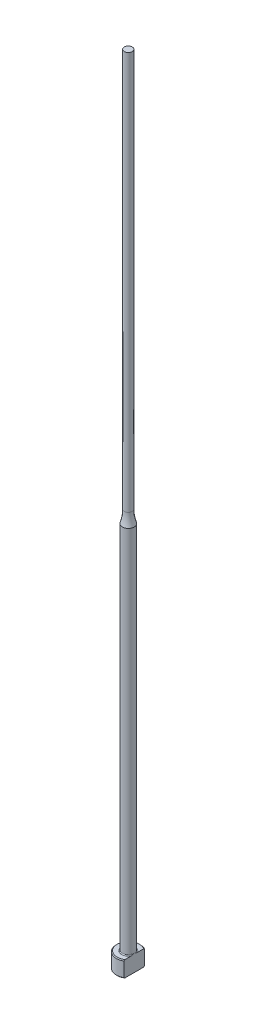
ISO-10303-21;
HEADER;
FILE_DESCRIPTION(('STEP AP214'),'2;1');
FILE_NAME('part.step','',(''),(''),'','','');
FILE_SCHEMA(('AUTOMOTIVE_DESIGN { 1 0 10303 214 1 1 1 1 }'));
ENDSEC;
DATA;
#1=APPLICATION_CONTEXT('core data for automotive mechanical design processes');
#2=APPLICATION_PROTOCOL_DEFINITION('international standard','automotive_design',2000,#1);
#3=PRODUCT_CONTEXT('',#1,'mechanical');
#4=PRODUCT('Part','Part','',(#3));
#5=PRODUCT_RELATED_PRODUCT_CATEGORY('part','',(#4));
#6=PRODUCT_DEFINITION_FORMATION('','',#4);
#7=PRODUCT_DEFINITION_CONTEXT('part definition',#1,'design');
#8=PRODUCT_DEFINITION('design','',#6,#7);
#9=PRODUCT_DEFINITION_SHAPE('','',#8);
#10=(LENGTH_UNIT() NAMED_UNIT(*) SI_UNIT(.MILLI.,.METRE.));
#11=(NAMED_UNIT(*) PLANE_ANGLE_UNIT() SI_UNIT($,.RADIAN.));
#12=(NAMED_UNIT(*) SI_UNIT($,.STERADIAN.) SOLID_ANGLE_UNIT());
#13=UNCERTAINTY_MEASURE_WITH_UNIT(LENGTH_MEASURE(1.E-05),#10,'distance_accuracy_value','');
#14=(GEOMETRIC_REPRESENTATION_CONTEXT(3) GLOBAL_UNCERTAINTY_ASSIGNED_CONTEXT((#13)) GLOBAL_UNIT_ASSIGNED_CONTEXT((#10,
#11,#12)) REPRESENTATION_CONTEXT('',''));
#15=CARTESIAN_POINT('',(0.,0.,0.));
#16=DIRECTION('',(0.,0.,1.));
#17=DIRECTION('',(1.,0.,0.));
#18=AXIS2_PLACEMENT_3D('',#15,#16,#17);
#19=CARTESIAN_POINT('',(-2.99999999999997,4.,0.));
#20=DIRECTION('',(0.,1.,0.));
#21=DIRECTION('',(0.,0.,1.));
#22=AXIS2_PLACEMENT_3D('',#19,#20,#21);
#23=PLANE('',#22);
#24=CARTESIAN_POINT('',(0.,4.,0.));
#25=DIRECTION('',(0.,1.,0.));
#26=DIRECTION('',(0.,0.,1.));
#27=AXIS2_PLACEMENT_3D('',#24,#25,#26);
#28=CIRCLE('',#27,2.79999999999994);
#29=CARTESIAN_POINT('',(1.49999999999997,4.,-2.36431808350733));
#30=VERTEX_POINT('',#29);
#31=CARTESIAN_POINT('',(1.49999999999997,4.,2.36431808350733));
#32=VERTEX_POINT('',#31);
#33=EDGE_CURVE('E187',#30,#32,#28,.T.);
#34=ORIENTED_EDGE('',*,*,#33,.T.);
#35=DIRECTION('',(0.,0.,-1.));
#36=VECTOR('',#35,1.);
#37=CARTESIAN_POINT('',(1.49999999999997,4.,0.));
#38=LINE('',#37,#36);
#39=CARTESIAN_POINT('',(1.49999999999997,3.99999999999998,0.799999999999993));
#40=VERTEX_POINT('',#39);
#41=EDGE_CURVE('E57',#32,#40,#38,.T.);
#42=ORIENTED_EDGE('',*,*,#41,.T.);
#43=CARTESIAN_POINT('',(0.,4.,0.));
#44=DIRECTION('',(0.,1.,0.));
#45=DIRECTION('',(0.,0.,1.));
#46=AXIS2_PLACEMENT_3D('',#43,#44,#45);
#47=CIRCLE('',#46,1.69999999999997);
#48=CARTESIAN_POINT('',(1.49999999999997,3.99999999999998,-0.799999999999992));
#49=VERTEX_POINT('',#48);
#50=EDGE_CURVE('E108',#40,#49,#47,.F.);
#51=ORIENTED_EDGE('',*,*,#50,.T.);
#52=EDGE_CURVE('E137',#49,#30,#38,.T.);
#53=ORIENTED_EDGE('',*,*,#52,.T.);
#54=EDGE_LOOP('',(#34,#42,#51,#53));
#55=FACE_BOUND('',#54,.T.);
#56=ADVANCED_FACE('F32',(#55),#23,.T.);
#57=CARTESIAN_POINT('',(0.,259.958771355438,0.));
#58=DIRECTION('',(0.,1.,0.));
#59=DIRECTION('',(0.,0.,1.));
#60=AXIS2_PLACEMENT_3D('',#57,#58,#59);
#61=CYLINDRICAL_SURFACE('',#60,2.99999999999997);
#62=CARTESIAN_POINT('',(0.,3.79999999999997,0.));
#63=DIRECTION('',(0.,1.,0.));
#64=DIRECTION('',(0.,0.,1.));
#65=AXIS2_PLACEMENT_3D('',#62,#63,#64);
#66=CIRCLE('',#65,2.99999999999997);
#67=CARTESIAN_POINT('',(1.49999999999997,3.79999999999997,2.5980762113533));
#68=VERTEX_POINT('',#67);
#69=CARTESIAN_POINT('',(1.49999999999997,3.79999999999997,-2.5980762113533));
#70=VERTEX_POINT('',#69);
#71=EDGE_CURVE('E105',#68,#70,#66,.F.);
#72=ORIENTED_EDGE('',*,*,#71,.T.);
#73=DIRECTION('',(0.,-1.,0.));
#74=VECTOR('',#73,1.);
#75=CARTESIAN_POINT('',(1.49999999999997,200.,-2.5980762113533));
#76=LINE('',#75,#74);
#77=CARTESIAN_POINT('',(1.49999999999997,0.200000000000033,-2.5980762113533));
#78=VERTEX_POINT('',#77);
#79=EDGE_CURVE('E193',#70,#78,#76,.T.);
#80=ORIENTED_EDGE('',*,*,#79,.T.);
#81=CARTESIAN_POINT('',(0.,0.200000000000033,0.));
#82=DIRECTION('',(0.,-1.,0.));
#83=DIRECTION('',(0.,0.,-1.));
#84=AXIS2_PLACEMENT_3D('',#81,#82,#83);
#85=CIRCLE('',#84,2.99999999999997);
#86=CARTESIAN_POINT('',(1.49999999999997,0.200000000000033,2.5980762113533));
#87=VERTEX_POINT('',#86);
#88=EDGE_CURVE('E100',#78,#87,#85,.F.);
#89=ORIENTED_EDGE('',*,*,#88,.T.);
#90=DIRECTION('',(0.,-1.,0.));
#91=VECTOR('',#90,1.);
#92=CARTESIAN_POINT('',(1.49999999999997,200.,2.5980762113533));
#93=LINE('',#92,#91);
#94=EDGE_CURVE('E93',#68,#87,#93,.T.);
#95=ORIENTED_EDGE('',*,*,#94,.F.);
#96=EDGE_LOOP('',(#72,#80,#89,#95));
#97=FACE_BOUND('',#96,.T.);
#98=ADVANCED_FACE('F158',(#97),#61,.T.);
#99=CARTESIAN_POINT('',(0.,0.,0.));
#100=DIRECTION('',(0.,-1.,0.));
#101=DIRECTION('',(0.,0.,-1.));
#102=AXIS2_PLACEMENT_3D('',#99,#100,#101);
#103=PLANE('',#102);
#104=CARTESIAN_POINT('',(0.,0.,0.));
#105=DIRECTION('',(0.,-1.,0.));
#106=DIRECTION('',(0.,0.,-1.));
#107=AXIS2_PLACEMENT_3D('',#104,#105,#106);
#108=CIRCLE('',#107,2.79999999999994);
#109=CARTESIAN_POINT('',(1.49999999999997,0.,2.36431808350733));
#110=VERTEX_POINT('',#109);
#111=CARTESIAN_POINT('',(1.49999999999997,0.,-2.36431808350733));
#112=VERTEX_POINT('',#111);
#113=EDGE_CURVE('E98',#110,#112,#108,.T.);
#114=ORIENTED_EDGE('',*,*,#113,.T.);
#115=DIRECTION('',(0.,0.,1.));
#116=VECTOR('',#115,1.);
#117=CARTESIAN_POINT('',(1.49999999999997,0.,2.5980762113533));
#118=LINE('',#117,#116);
#119=EDGE_CURVE('E83',#112,#110,#118,.T.);
#120=ORIENTED_EDGE('',*,*,#119,.T.);
#121=EDGE_LOOP('',(#114,#120));
#122=FACE_BOUND('',#121,.T.);
#123=ADVANCED_FACE('F103',(#122),#103,.T.);
#124=CARTESIAN_POINT('',(0.,4.,0.));
#125=DIRECTION('',(0.,-1.,0.));
#126=DIRECTION('',(0.,0.,-1.));
#127=AXIS2_PLACEMENT_3D('',#124,#125,#126);
#128=CONICAL_SURFACE('',#127,2.79999999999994,0.785398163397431);
#129=ORIENTED_EDGE('',*,*,#71,.F.);
#130=CARTESIAN_POINT('',(1.49999999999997,0.888258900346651,5.71827621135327));
#131=CARTESIAN_POINT('',(1.49999999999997,1.01361833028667,5.58866816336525));
#132=CARTESIAN_POINT('',(1.49999999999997,1.13884324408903,5.45892957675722));
#133=CARTESIAN_POINT('',(1.49999999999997,1.38894444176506,5.19911365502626));
#134=CARTESIAN_POINT('',(1.49999999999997,1.51382072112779,5.06903631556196));
#135=CARTESIAN_POINT('',(1.49999999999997,1.76320568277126,4.80840180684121));
#136=CARTESIAN_POINT('',(1.49999999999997,1.88771414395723,4.67784442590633));
#137=CARTESIAN_POINT('',(1.49999999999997,2.13618059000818,4.4162081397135));
#138=CARTESIAN_POINT('',(1.49999999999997,2.26013857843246,4.28512923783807));
#139=CARTESIAN_POINT('',(1.49999999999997,2.50488975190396,4.02490837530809));
#140=CARTESIAN_POINT('',(1.49999999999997,2.62569693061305,3.8957795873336));
#141=CARTESIAN_POINT('',(1.49999999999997,2.86640694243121,3.63668213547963));
#142=CARTESIAN_POINT('',(1.49999999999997,2.98630978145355,3.50671347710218));
#143=CARTESIAN_POINT('',(1.49999999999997,3.22486033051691,3.24567921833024));
#144=CARTESIAN_POINT('',(1.49999999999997,3.3435083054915,3.11461386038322));
#145=CARTESIAN_POINT('',(1.49999999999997,3.5790771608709,2.85094268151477));
#146=CARTESIAN_POINT('',(1.49999999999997,3.69599811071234,2.71833692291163));
#147=CARTESIAN_POINT('',(1.49999999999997,3.88262371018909,2.50255231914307));
#148=CARTESIAN_POINT('',(1.49999999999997,3.95312454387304,2.42006293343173));
#149=CARTESIAN_POINT('',(1.49999999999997,4.09287098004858,2.254010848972));
#150=CARTESIAN_POINT('',(1.49999999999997,4.16211645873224,2.17044804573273));
#151=CARTESIAN_POINT('',(1.49999999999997,4.29964684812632,2.00105967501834));
#152=CARTESIAN_POINT('',(1.49999999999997,4.36791386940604,1.9152195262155));
#153=CARTESIAN_POINT('',(1.49999999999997,4.50205840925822,1.7417139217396));
#154=CARTESIAN_POINT('',(1.49999999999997,4.56793649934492,1.65404891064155));
#155=CARTESIAN_POINT('',(1.49999999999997,4.69728151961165,1.47490236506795));
#156=CARTESIAN_POINT('',(1.49999999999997,4.76069661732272,1.38338308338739));
#157=CARTESIAN_POINT('',(1.49999999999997,4.88239539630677,1.19675661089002));
#158=CARTESIAN_POINT('',(1.49999999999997,4.94067201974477,1.10164473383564));
#159=CARTESIAN_POINT('',(1.49999999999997,5.048413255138,0.908008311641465));
#160=CARTESIAN_POINT('',(1.49999999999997,5.09797809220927,0.809540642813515));
#161=CARTESIAN_POINT('',(1.49999999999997,5.18432188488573,0.607192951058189));
#162=CARTESIAN_POINT('',(1.49999999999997,5.22114374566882,0.50333247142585));
#163=CARTESIAN_POINT('',(1.49999999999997,5.26099935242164,0.347577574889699));
#164=CARTESIAN_POINT('',(1.49999999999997,5.2715702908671,0.297609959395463));
#165=CARTESIAN_POINT('',(1.49999999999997,5.28794860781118,0.196885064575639));
#166=CARTESIAN_POINT('',(1.49999999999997,5.29375640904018,0.146127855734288));
#167=CARTESIAN_POINT('',(1.49999999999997,5.30019707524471,0.0444388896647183));
#168=CARTESIAN_POINT('',(1.49999999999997,5.30084594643,-0.00649183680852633));
#169=CARTESIAN_POINT('',(1.49999999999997,5.29696416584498,-0.108155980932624));
#170=CARTESIAN_POINT('',(1.49999999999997,5.29243308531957,-0.158889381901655));
#171=CARTESIAN_POINT('',(1.49999999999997,5.27856915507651,-0.259234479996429));
#172=CARTESIAN_POINT('',(1.49999999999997,5.2692782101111,-0.308852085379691));
#173=CARTESIAN_POINT('',(1.49999999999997,5.24647108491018,-0.407110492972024));
#174=CARTESIAN_POINT('',(1.49999999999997,5.23295324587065,-0.45575090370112));
#175=CARTESIAN_POINT('',(1.49999999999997,5.20226175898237,-0.55214996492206));
#176=CARTESIAN_POINT('',(1.49999999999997,5.18506801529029,-0.599902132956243));
#177=CARTESIAN_POINT('',(1.49999999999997,5.1477138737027,-0.694205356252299));
#178=CARTESIAN_POINT('',(1.49999999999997,5.12755408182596,-0.740756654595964));
#179=CARTESIAN_POINT('',(1.49999999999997,5.0632769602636,-0.879166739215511));
#180=CARTESIAN_POINT('',(1.49999999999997,5.01551721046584,-0.969329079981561));
#181=CARTESIAN_POINT('',(1.49999999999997,4.91367909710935,-1.14604316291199));
#182=CARTESIAN_POINT('',(1.49999999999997,4.85959300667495,-1.2325903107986));
#183=CARTESIAN_POINT('',(1.49999999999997,4.74697968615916,-1.40321348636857));
#184=CARTESIAN_POINT('',(1.49999999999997,4.68843573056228,-1.4872783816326));
#185=CARTESIAN_POINT('',(1.49999999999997,4.5684384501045,-1.65322187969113));
#186=CARTESIAN_POINT('',(1.49999999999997,4.50698656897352,-1.73510153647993));
#187=CARTESIAN_POINT('',(1.49999999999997,4.3811567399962,-1.89829823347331));
#188=CARTESIAN_POINT('',(1.49999999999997,4.31675092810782,-1.97959369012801));
#189=CARTESIAN_POINT('',(1.49999999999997,4.18634068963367,-2.14090082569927));
#190=CARTESIAN_POINT('',(1.49999999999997,4.12033609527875,-2.22091236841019));
#191=CARTESIAN_POINT('',(1.49999999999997,3.92086431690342,-2.45906508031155));
#192=CARTESIAN_POINT('',(1.49999999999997,3.78562663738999,-2.61572090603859));
#193=CARTESIAN_POINT('',(1.49999999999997,3.53554498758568,-2.90006295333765));
#194=CARTESIAN_POINT('',(1.49999999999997,3.42114543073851,-3.02814382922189));
#195=CARTESIAN_POINT('',(1.49999999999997,3.1909355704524,-3.28303767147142));
#196=CARTESIAN_POINT('',(1.49999999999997,3.07512522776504,-3.40985060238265));
#197=CARTESIAN_POINT('',(1.49999999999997,2.72597067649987,-3.78913849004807));
#198=CARTESIAN_POINT('',(1.49999999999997,2.49111760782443,-4.04022177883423));
#199=CARTESIAN_POINT('',(1.49999999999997,2.0288247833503,-4.52992803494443));
#200=CARTESIAN_POINT('',(1.49999999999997,1.80147747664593,-4.7686387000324));
#201=CARTESIAN_POINT('',(1.49999999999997,1.45954865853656,-5.12558036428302));
#202=CARTESIAN_POINT('',(1.49999999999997,1.34548484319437,-5.24430773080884));
#203=CARTESIAN_POINT('',(1.49999999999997,1.11707176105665,-5.48148573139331));
#204=CARTESIAN_POINT('',(1.49999999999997,1.00272249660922,-5.59993636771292));
#205=CARTESIAN_POINT('',(1.49999999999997,0.888258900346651,-5.71827621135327));
#206=B_SPLINE_CURVE_WITH_KNOTS('',3,(#130,#131,#132,#133,#134,#135,#136,#137,#138,#139,#140,
#141,#142,#143,#144,#145,#146,#147,#148,#149,#150,#151,#152,#153,#154,#155,#156,#157,#158,#159,
#160,#161,#162,#163,#164,#165,#166,#167,#168,#169,#170,#171,#172,#173,#174,#175,#176,#177,#178,
#179,#180,#181,#182,#183,#184,#185,#186,#187,#188,#189,#190,#191,#192,#193,#194,#195,#196,#197,
#198,#199,#200,#201,#202,#203,#204,#205),.UNSPECIFIED.,.F.,.F.,(4,2,2,2,2,2,2,2,2,2,2,2,2,2,2,2,
2,2,2,2,2,2,2,2,2,2,2,2,2,2,2,2,2,2,2,2,2,4),(0.,0.540943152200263,1.08189327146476,
1.62312052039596,2.16434426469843,2.69482920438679,3.22531067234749,3.75567781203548,
4.28602356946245,4.611550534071,4.9371094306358,5.26610945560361,5.59503024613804,
5.92894782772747,6.26331713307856,6.59354403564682,6.92264800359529,7.07567478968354,
7.22868799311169,7.38122626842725,7.53377717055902,7.68500755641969,7.83629736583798,
7.988436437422,8.14054446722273,8.44618799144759,8.75220879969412,9.05944044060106,
9.36652111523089,9.6776428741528,9.98879742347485,10.609592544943,11.1247803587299,
11.6399825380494,12.6713544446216,13.6603005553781,14.1542238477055,14.6481430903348),.UNSPECIFIED.);
#207=EDGE_CURVE('E136',#68,#32,#206,.T.);
#208=ORIENTED_EDGE('',*,*,#207,.T.);
#209=ORIENTED_EDGE('',*,*,#33,.F.);
#210=EDGE_CURVE('E128',#30,#70,#206,.T.);
#211=ORIENTED_EDGE('',*,*,#210,.T.);
#212=EDGE_LOOP('',(#129,#208,#209,#211));
#213=FACE_BOUND('',#212,.T.);
#214=ADVANCED_FACE('F144',(#213),#128,.T.);
#215=CARTESIAN_POINT('',(0.,0.200000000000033,0.));
#216=DIRECTION('',(0.,1.,0.));
#217=DIRECTION('',(0.,0.,1.));
#218=AXIS2_PLACEMENT_3D('',#215,#216,#217);
#219=CONICAL_SURFACE('',#218,2.99999999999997,0.785398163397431);
#220=ORIENTED_EDGE('',*,*,#88,.F.);
#221=CARTESIAN_POINT('',(1.49999999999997,3.11174109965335,-5.71827621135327));
#222=CARTESIAN_POINT('',(1.49999999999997,2.98638166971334,-5.58866816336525));
#223=CARTESIAN_POINT('',(1.49999999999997,2.86115675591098,-5.45892957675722));
#224=CARTESIAN_POINT('',(1.49999999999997,2.61105555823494,-5.19911365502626));
#225=CARTESIAN_POINT('',(1.49999999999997,2.48617927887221,-5.06903631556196));
#226=CARTESIAN_POINT('',(1.49999999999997,2.23679431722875,-4.80840180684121));
#227=CARTESIAN_POINT('',(1.49999999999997,2.11228585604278,-4.67784442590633));
#228=CARTESIAN_POINT('',(1.49999999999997,1.86381940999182,-4.4162081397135));
#229=CARTESIAN_POINT('',(1.49999999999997,1.73986142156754,-4.28512923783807));
#230=CARTESIAN_POINT('',(1.49999999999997,1.49511024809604,-4.02490837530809));
#231=CARTESIAN_POINT('',(1.49999999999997,1.37430306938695,-3.8957795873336));
#232=CARTESIAN_POINT('',(1.49999999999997,1.13359305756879,-3.63668213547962));
#233=CARTESIAN_POINT('',(1.49999999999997,1.01369021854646,-3.50671347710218));
#234=CARTESIAN_POINT('',(1.49999999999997,0.775139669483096,-3.24567921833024));
#235=CARTESIAN_POINT('',(1.49999999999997,0.656491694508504,-3.11461386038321));
#236=CARTESIAN_POINT('',(1.49999999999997,0.420922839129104,-2.85094268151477));
#237=CARTESIAN_POINT('',(1.49999999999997,0.304001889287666,-2.71833692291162));
#238=CARTESIAN_POINT('',(1.49999999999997,0.117376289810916,-2.50255231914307));
#239=CARTESIAN_POINT('',(1.49999999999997,0.0468754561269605,-2.42006293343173));
#240=CARTESIAN_POINT('',(1.49999999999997,-0.0928709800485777,-2.254010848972));
#241=CARTESIAN_POINT('',(1.49999999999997,-0.162116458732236,-2.17044804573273));
#242=CARTESIAN_POINT('',(1.49999999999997,-0.299646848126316,-2.00105967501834));
#243=CARTESIAN_POINT('',(1.49999999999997,-0.367913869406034,-1.9152195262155));
#244=CARTESIAN_POINT('',(1.49999999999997,-0.502058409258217,-1.7417139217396));
#245=CARTESIAN_POINT('',(1.49999999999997,-0.567936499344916,-1.65404891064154));
#246=CARTESIAN_POINT('',(1.49999999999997,-0.697281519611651,-1.47490236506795));
#247=CARTESIAN_POINT('',(1.49999999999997,-0.760696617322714,-1.38338308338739));
#248=CARTESIAN_POINT('',(1.49999999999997,-0.882395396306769,-1.19675661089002));
#249=CARTESIAN_POINT('',(1.49999999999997,-0.940672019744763,-1.10164473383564));
#250=CARTESIAN_POINT('',(1.49999999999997,-1.048413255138,-0.908008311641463));
#251=CARTESIAN_POINT('',(1.49999999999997,-1.09797809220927,-0.809540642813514));
#252=CARTESIAN_POINT('',(1.49999999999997,-1.18432188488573,-0.607192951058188));
#253=CARTESIAN_POINT('',(1.49999999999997,-1.22114374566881,-0.503332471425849));
#254=CARTESIAN_POINT('',(1.49999999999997,-1.26099935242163,-0.347577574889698));
#255=CARTESIAN_POINT('',(1.49999999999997,-1.2715702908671,-0.297609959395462));
#256=CARTESIAN_POINT('',(1.49999999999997,-1.28794860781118,-0.196885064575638));
#257=CARTESIAN_POINT('',(1.49999999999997,-1.29375640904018,-0.146127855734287));
#258=CARTESIAN_POINT('',(1.49999999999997,-1.30019707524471,-0.0444388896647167));
#259=CARTESIAN_POINT('',(1.49999999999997,-1.30084594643,0.00649183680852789));
#260=CARTESIAN_POINT('',(1.49999999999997,-1.29696416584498,0.108155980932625));
#261=CARTESIAN_POINT('',(1.49999999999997,-1.29243308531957,0.158889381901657));
#262=CARTESIAN_POINT('',(1.49999999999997,-1.2785691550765,0.259234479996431));
#263=CARTESIAN_POINT('',(1.49999999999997,-1.2692782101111,0.308852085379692));
#264=CARTESIAN_POINT('',(1.49999999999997,-1.24647108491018,0.407110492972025));
#265=CARTESIAN_POINT('',(1.49999999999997,-1.23295324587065,0.455750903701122));
#266=CARTESIAN_POINT('',(1.49999999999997,-1.20226175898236,0.552149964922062));
#267=CARTESIAN_POINT('',(1.49999999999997,-1.18506801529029,0.599902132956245));
#268=CARTESIAN_POINT('',(1.49999999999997,-1.14771387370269,0.694205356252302));
#269=CARTESIAN_POINT('',(1.49999999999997,-1.12755408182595,0.740756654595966));
#270=CARTESIAN_POINT('',(1.49999999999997,-1.0632769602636,0.879166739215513));
#271=CARTESIAN_POINT('',(1.49999999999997,-1.01551721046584,0.969329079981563));
#272=CARTESIAN_POINT('',(1.49999999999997,-0.913679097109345,1.14604316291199));
#273=CARTESIAN_POINT('',(1.49999999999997,-0.859593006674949,1.2325903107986));
#274=CARTESIAN_POINT('',(1.49999999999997,-0.746979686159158,1.40321348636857));
#275=CARTESIAN_POINT('',(1.49999999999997,-0.688435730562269,1.4872783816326));
#276=CARTESIAN_POINT('',(1.49999999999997,-0.568438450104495,1.65322187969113));
#277=CARTESIAN_POINT('',(1.49999999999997,-0.506986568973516,1.73510153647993));
#278=CARTESIAN_POINT('',(1.49999999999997,-0.381156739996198,1.89829823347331));
#279=CARTESIAN_POINT('',(1.49999999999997,-0.316750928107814,1.97959369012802));
#280=CARTESIAN_POINT('',(1.49999999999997,-0.186340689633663,2.14090082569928));
#281=CARTESIAN_POINT('',(1.49999999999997,-0.12033609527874,2.22091236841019));
#282=CARTESIAN_POINT('',(1.49999999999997,0.0791356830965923,2.45906508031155));
#283=CARTESIAN_POINT('',(1.49999999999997,0.214373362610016,2.61572090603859));
#284=CARTESIAN_POINT('',(1.49999999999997,0.46445501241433,2.90006295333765));
#285=CARTESIAN_POINT('',(1.49999999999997,0.578854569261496,3.02814382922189));
#286=CARTESIAN_POINT('',(1.49999999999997,0.809064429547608,3.28303767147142));
#287=CARTESIAN_POINT('',(1.49999999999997,0.924874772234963,3.40985060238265));
#288=CARTESIAN_POINT('',(1.49999999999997,1.27402932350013,3.78913849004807));
#289=CARTESIAN_POINT('',(1.49999999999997,1.50888239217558,4.04022177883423));
#290=CARTESIAN_POINT('',(1.49999999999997,1.97117521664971,4.52992803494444));
#291=CARTESIAN_POINT('',(1.49999999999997,2.19852252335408,4.76863870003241));
#292=CARTESIAN_POINT('',(1.49999999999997,2.54045134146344,5.12558036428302));
#293=CARTESIAN_POINT('',(1.49999999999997,2.65451515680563,5.24430773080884));
#294=CARTESIAN_POINT('',(1.49999999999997,2.88292823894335,5.48148573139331));
#295=CARTESIAN_POINT('',(1.49999999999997,2.99727750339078,5.59993636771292));
#296=CARTESIAN_POINT('',(1.49999999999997,3.11174109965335,5.71827621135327));
#297=B_SPLINE_CURVE_WITH_KNOTS('',3,(#221,#222,#223,#224,#225,#226,#227,#228,#229,#230,#231,
#232,#233,#234,#235,#236,#237,#238,#239,#240,#241,#242,#243,#244,#245,#246,#247,#248,#249,#250,
#251,#252,#253,#254,#255,#256,#257,#258,#259,#260,#261,#262,#263,#264,#265,#266,#267,#268,#269,
#270,#271,#272,#273,#274,#275,#276,#277,#278,#279,#280,#281,#282,#283,#284,#285,#286,#287,#288,
#289,#290,#291,#292,#293,#294,#295,#296),.UNSPECIFIED.,.F.,.F.,(4,2,2,2,2,2,2,2,2,2,2,2,2,2,2,2,
2,2,2,2,2,2,2,2,2,2,2,2,2,2,2,2,2,2,2,2,2,4),(0.,0.540943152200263,1.08189327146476,
1.62312052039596,2.16434426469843,2.69482920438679,3.22531067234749,3.75567781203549,
4.28602356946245,4.611550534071,4.9371094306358,5.26610945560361,5.59503024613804,
5.92894782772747,6.26331713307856,6.59354403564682,6.92264800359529,7.07567478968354,
7.2286879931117,7.38122626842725,7.53377717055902,7.6850075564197,7.83629736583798,
7.98843643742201,8.14054446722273,8.44618799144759,8.75220879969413,9.05944044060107,
9.3665211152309,9.6776428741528,9.98879742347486,10.609592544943,11.1247803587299,
11.6399825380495,12.6713544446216,13.6603005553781,14.1542238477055,14.6481430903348),.UNSPECIFIED.);
#298=EDGE_CURVE('E86',#78,#112,#297,.T.);
#299=ORIENTED_EDGE('',*,*,#298,.T.);
#300=ORIENTED_EDGE('',*,*,#113,.F.);
#301=EDGE_CURVE('E89',#110,#87,#297,.T.);
#302=ORIENTED_EDGE('',*,*,#301,.T.);
#303=EDGE_LOOP('',(#220,#299,#300,#302));
#304=FACE_BOUND('',#303,.T.);
#305=ADVANCED_FACE('F97',(#304),#219,.T.);
#306=CARTESIAN_POINT('',(0.,4.19999999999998,0.));
#307=DIRECTION('',(0.,1.,0.));
#308=DIRECTION('',(0.,0.,1.));
#309=AXIS2_PLACEMENT_3D('',#306,#307,#308);
#310=TOROIDAL_SURFACE('',#309,1.69999999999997,0.2);
#311=CARTESIAN_POINT('',(1.49999999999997,4.19999999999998,0.));
#312=CARTESIAN_POINT('',(1.49999999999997,4.20000050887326,7.14686674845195E-11));
#313=CARTESIAN_POINT('',(1.49999999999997,4.20000101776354,-1.21663673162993E-07));
#314=CARTESIAN_POINT('',(1.49999999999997,4.20000199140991,-4.97616237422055E-07));
#315=CARTESIAN_POINT('',(1.49999999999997,4.20000245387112,-7.56516220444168E-07));
#316=CARTESIAN_POINT('',(1.49999999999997,4.20000338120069,-1.37642837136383E-06));
#317=CARTESIAN_POINT('',(1.49999999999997,4.20000384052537,-1.74563476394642E-06));
#318=CARTESIAN_POINT('',(1.49999999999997,4.20000469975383,-2.53565984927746E-06));
#319=CARTESIAN_POINT('',(1.49999999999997,4.20000510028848,-2.95582597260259E-06));
#320=CARTESIAN_POINT('',(1.49999999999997,4.20000646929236,-4.48430445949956E-06));
#321=CARTESIAN_POINT('',(1.49999999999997,4.20000736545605,-5.6586103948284E-06));
#322=CARTESIAN_POINT('',(1.49999999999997,4.20000893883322,-8.06479202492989E-06));
#323=CARTESIAN_POINT('',(1.49999999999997,4.20000962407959,-9.29170517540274E-06));
#324=CARTESIAN_POINT('',(1.49999999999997,4.20001225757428,-1.416232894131E-05));
#325=CARTESIAN_POINT('',(1.49999999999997,4.20001407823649,-1.78790031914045E-05));
#326=CARTESIAN_POINT('',(1.49999999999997,4.20001699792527,-2.51443066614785E-05));
#327=CARTESIAN_POINT('',(1.49999999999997,4.20001815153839,-2.86715394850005E-05));
#328=CARTESIAN_POINT('',(1.49999999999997,4.20002315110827,-4.39218128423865E-05));
#329=CARTESIAN_POINT('',(1.49999999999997,4.20002701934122,-5.56288390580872E-05));
#330=CARTESIAN_POINT('',(1.49999999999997,4.20003312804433,-7.7405829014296E-05));
#331=CARTESIAN_POINT('',(1.49999999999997,4.20003553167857,-8.74278412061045E-05));
#332=CARTESIAN_POINT('',(1.49999999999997,4.20005483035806,-0.000161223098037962));
#333=CARTESIAN_POINT('',(1.49999999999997,4.20007979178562,-0.000222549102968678));
#334=CARTESIAN_POINT('',(1.49999999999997,4.20017391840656,-0.000462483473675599));
#335=CARTESIAN_POINT('',(1.49999999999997,4.20023706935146,-0.000642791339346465));
#336=CARTESIAN_POINT('',(1.49999999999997,4.20048761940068,-0.00134785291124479));
#337=CARTESIAN_POINT('',(1.49999999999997,4.20068132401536,-0.00187087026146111));
#338=CARTESIAN_POINT('',(1.49999999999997,4.20147357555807,-0.00402004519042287));
#339=CARTESIAN_POINT('',(1.49999999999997,4.20206499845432,-0.0056481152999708));
#340=CARTESIAN_POINT('',(1.49999999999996,4.20892634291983,-0.0245232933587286));
#341=CARTESIAN_POINT('',(1.49999999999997,4.21523683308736,-0.041759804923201));
#342=CARTESIAN_POINT('',(1.49999999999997,4.22755028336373,-0.0756091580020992));
#343=CARTESIAN_POINT('',(1.49999999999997,4.23355589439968,-0.0922211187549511));
#344=CARTESIAN_POINT('',(1.49999999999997,4.24620101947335,-0.127454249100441));
#345=CARTESIAN_POINT('',(1.49999999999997,4.25283080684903,-0.146078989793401));
#346=CARTESIAN_POINT('',(1.49999999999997,4.26599765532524,-0.183577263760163));
#347=CARTESIAN_POINT('',(1.49999999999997,4.27253305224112,-0.202451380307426));
#348=CARTESIAN_POINT('',(1.49999999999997,4.28834228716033,-0.248982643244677));
#349=CARTESIAN_POINT('',(1.49999999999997,4.2974915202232,-0.276682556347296));
#350=CARTESIAN_POINT('',(1.49999999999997,4.31490935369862,-0.331625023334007));
#351=CARTESIAN_POINT('',(1.49999999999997,4.3231938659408,-0.358862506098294));
#352=CARTESIAN_POINT('',(1.49999999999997,4.34051594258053,-0.419125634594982));
#353=CARTESIAN_POINT('',(1.49999999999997,4.34936607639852,-0.452206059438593));
#354=CARTESIAN_POINT('',(1.49999999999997,4.36549583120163,-0.519023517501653));
#355=CARTESIAN_POINT('',(1.49999999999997,4.37276283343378,-0.552763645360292));
#356=CARTESIAN_POINT('',(1.49999999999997,4.38554755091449,-0.62305310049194));
#357=CARTESIAN_POINT('',(1.49999999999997,4.39090573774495,-0.65963271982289));
#358=CARTESIAN_POINT('',(1.49999999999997,4.39825016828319,-0.733028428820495));
#359=CARTESIAN_POINT('',(1.49999999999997,4.40024734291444,-0.76984335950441));
#360=CARTESIAN_POINT('',(1.49999999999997,4.39970780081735,-0.842856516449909));
#361=CARTESIAN_POINT('',(1.49999999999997,4.39725347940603,-0.879053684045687));
#362=CARTESIAN_POINT('',(1.49999999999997,4.38900085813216,-0.93238076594));
#363=CARTESIAN_POINT('',(1.49999999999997,4.38553049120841,-0.949868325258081));
#364=CARTESIAN_POINT('',(1.49999999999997,4.37678336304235,-0.984374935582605));
#365=CARTESIAN_POINT('',(1.49999999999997,4.37150943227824,-1.00139467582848));
#366=CARTESIAN_POINT('',(1.49999999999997,4.35869781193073,-1.03479423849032));
#367=CARTESIAN_POINT('',(1.49999999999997,4.3511359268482,-1.05116499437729));
#368=CARTESIAN_POINT('',(1.49999999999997,4.33325333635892,-1.08234828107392));
#369=CARTESIAN_POINT('',(1.49999999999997,4.32294266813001,-1.09716621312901));
#370=CARTESIAN_POINT('',(1.49999999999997,4.30512758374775,-1.11714173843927));
#371=CARTESIAN_POINT('',(1.49999999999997,4.29884721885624,-1.12339066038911));
#372=CARTESIAN_POINT('',(1.49999999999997,4.28545950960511,-1.13494695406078));
#373=CARTESIAN_POINT('',(1.49999999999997,4.27835226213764,-1.14025443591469));
#374=CARTESIAN_POINT('',(1.49999999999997,4.26325970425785,-1.14967631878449));
#375=CARTESIAN_POINT('',(1.49999999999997,4.25526534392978,-1.15377649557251));
#376=CARTESIAN_POINT('',(1.49999999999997,4.23863207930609,-1.16034952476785));
#377=CARTESIAN_POINT('',(1.49999999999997,4.22999427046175,-1.16282507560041));
#378=CARTESIAN_POINT('',(1.49999999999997,4.21343922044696,-1.16570267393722));
#379=CARTESIAN_POINT('',(1.49999999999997,4.20555896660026,-1.16631687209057));
#380=CARTESIAN_POINT('',(1.49999999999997,4.18982775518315,-1.16602054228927));
#381=CARTESIAN_POINT('',(1.49999999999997,4.18197679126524,-1.16511036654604));
#382=CARTESIAN_POINT('',(1.49999999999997,4.16747846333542,-1.16204446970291));
#383=CARTESIAN_POINT('',(1.49999999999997,4.16079696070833,-1.16004509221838));
#384=CARTESIAN_POINT('',(1.49999999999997,4.14781700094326,-1.15505972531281));
#385=CARTESIAN_POINT('',(1.49999999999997,4.14151862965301,-1.1520735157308));
#386=CARTESIAN_POINT('',(1.49999999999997,4.12690214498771,-1.14387585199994));
#387=CARTESIAN_POINT('',(1.49999999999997,4.11881436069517,-1.13825400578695));
#388=CARTESIAN_POINT('',(1.49999999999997,4.1036444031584,-1.12578441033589));
#389=CARTESIAN_POINT('',(1.49999999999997,4.09656475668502,-1.11893367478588));
#390=CARTESIAN_POINT('',(1.49999999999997,4.08012297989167,-1.10074342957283));
#391=CARTESIAN_POINT('',(1.49999999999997,4.07136543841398,-1.08886044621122));
#392=CARTESIAN_POINT('',(1.49999999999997,4.05578194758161,-1.06392743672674));
#393=CARTESIAN_POINT('',(1.49999999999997,4.0489571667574,-1.05087671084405));
#394=CARTESIAN_POINT('',(1.49999999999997,4.03273856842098,-1.01472307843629));
#395=CARTESIAN_POINT('',(1.49999999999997,4.02486230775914,-0.990945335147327));
#396=CARTESIAN_POINT('',(1.49999999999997,4.01257693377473,-0.94232199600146));
#397=CARTESIAN_POINT('',(1.49999999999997,4.00820590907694,-0.917467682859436));
#398=CARTESIAN_POINT('',(1.49999999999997,4.00229956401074,-0.867912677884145));
#399=CARTESIAN_POINT('',(1.49999999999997,4.0007128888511,-0.843217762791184));
#400=CARTESIAN_POINT('',(1.49999999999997,3.9996723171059,-0.79374605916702));
#401=CARTESIAN_POINT('',(1.49999999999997,4.0002230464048,-0.768969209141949));
#402=CARTESIAN_POINT('',(1.49999999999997,4.00433101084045,-0.696994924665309));
#403=CARTESIAN_POINT('',(1.49999999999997,4.01016976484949,-0.64993124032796));
#404=CARTESIAN_POINT('',(1.49999999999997,4.02567776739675,-0.559166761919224));
#405=CARTESIAN_POINT('',(1.49999999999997,4.03511950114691,-0.515423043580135));
#406=CARTESIAN_POINT('',(1.49999999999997,4.05693059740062,-0.427590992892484));
#407=CARTESIAN_POINT('',(1.49999999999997,4.06936356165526,-0.383518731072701));
#408=CARTESIAN_POINT('',(1.49999999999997,4.09174953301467,-0.310161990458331));
#409=CARTESIAN_POINT('',(1.49999999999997,4.10119843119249,-0.280718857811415));
#410=CARTESIAN_POINT('',(1.49999999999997,4.12060442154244,-0.22234098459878));
#411=CARTESIAN_POINT('',(1.49999999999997,4.13055519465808,-0.193404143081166));
#412=CARTESIAN_POINT('',(1.49999999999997,4.14973721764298,-0.138756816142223));
#413=CARTESIAN_POINT('',(1.49999999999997,4.15893123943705,-0.113033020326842));
#414=CARTESIAN_POINT('',(1.49999999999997,4.17788037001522,-0.0606351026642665));
#415=CARTESIAN_POINT('',(1.49999999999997,4.18764328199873,-0.0339636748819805));
#416=CARTESIAN_POINT('',(1.49999999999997,4.19793548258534,-0.00564657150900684));
#417=CARTESIAN_POINT('',(1.49999999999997,4.19852751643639,-0.00401699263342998));
#418=CARTESIAN_POINT('',(1.49999999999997,4.1993199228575,-0.0018674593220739));
#419=CARTESIAN_POINT('',(1.49999999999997,4.19951319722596,-0.00134559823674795));
#420=CARTESIAN_POINT('',(1.49999999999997,4.19976322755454,-0.000641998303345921));
#421=CARTESIAN_POINT('',(1.49999999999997,4.19982627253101,-0.000461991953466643));
#422=CARTESIAN_POINT('',(1.49999999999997,4.19992025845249,-0.000222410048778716));
#423=CARTESIAN_POINT('',(1.49999999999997,4.19994519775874,-0.000161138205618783));
#424=CARTESIAN_POINT('',(1.49999999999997,4.19996448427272,-8.74039267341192E-05));
#425=CARTESIAN_POINT('',(1.49999999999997,4.19996688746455,-7.73857556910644E-05));
#426=CARTESIAN_POINT('',(1.49999999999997,4.1999729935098,-5.56173272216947E-05));
#427=CARTESIAN_POINT('',(1.49999999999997,4.19997685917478,-4.39149186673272E-05));
#428=CARTESIAN_POINT('',(1.49999999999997,4.19998185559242,-2.86698156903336E-05));
#429=CARTESIAN_POINT('',(1.49999999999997,4.19998300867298,-2.51431575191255E-05));
#430=CARTESIAN_POINT('',(1.49999999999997,4.19998592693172,-1.78789552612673E-05));
#431=CARTESIAN_POINT('',(1.49999999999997,4.19998774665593,-1.41627846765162E-05));
#432=CARTESIAN_POINT('',(1.49999999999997,4.19999037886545,-9.29264488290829E-06));
#433=CARTESIAN_POINT('',(1.49999999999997,4.19999106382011,-8.06577599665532E-06));
#434=CARTESIAN_POINT('',(1.49999999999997,4.19999263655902,-5.65962639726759E-06));
#435=CARTESIAN_POINT('',(1.49999999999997,4.19999353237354,-4.48530466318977E-06));
#436=CARTESIAN_POINT('',(1.49999999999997,4.19999490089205,-2.95673740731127E-06));
#437=CARTESIAN_POINT('',(1.49999999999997,4.1999953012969,-2.53653208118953E-06));
#438=CARTESIAN_POINT('',(1.49999999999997,4.19999616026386,-1.74640525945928E-06));
#439=CARTESIAN_POINT('',(1.49999999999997,4.19999661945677,-1.37713598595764E-06));
#440=CARTESIAN_POINT('',(1.49999999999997,4.19999754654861,-7.57072336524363E-07));
#441=CARTESIAN_POINT('',(1.49999999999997,4.19999800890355,-4.9808738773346E-07));
#442=CARTESIAN_POINT('',(1.49999999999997,4.19999898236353,-1.21927249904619E-07));
#443=CARTESIAN_POINT('',(1.49999999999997,4.19999949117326,-7.14621294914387E-11));
#444=CARTESIAN_POINT('',(1.49999999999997,4.19999999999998,0.));
#445=B_SPLINE_CURVE_WITH_KNOTS('',3,(#311,#312,#313,#314,#315,#316,#317,#318,#319,#320,#321,
#322,#323,#324,#325,#326,#327,#328,#329,#330,#331,#332,#333,#334,#335,#336,#337,#338,#339,#340,
#341,#342,#343,#344,#345,#346,#347,#348,#349,#350,#351,#352,#353,#354,#355,#356,#357,#358,#359,
#360,#361,#362,#363,#364,#365,#366,#367,#368,#369,#370,#371,#372,#373,#374,#375,#376,#377,#378,
#379,#380,#381,#382,#383,#384,#385,#386,#387,#388,#389,#390,#391,#392,#393,#394,#395,#396,#397,
#398,#399,#400,#401,#402,#403,#404,#405,#406,#407,#408,#409,#410,#411,#412,#413,#414,#415,#416,
#417,#418,#419,#420,#421,#422,#423,#424,#425,#426,#427,#428,#429,#430,#431,#432,#433,#434,#435,
#436,#437,#438,#439,#440,#441,#442,#443,#444),.UNSPECIFIED.,.T.,.F.,(4,2,2,2,2,2,2,2,2,2,2,2,2,
2,2,2,2,2,2,2,2,2,2,2,2,2,2,2,2,2,2,2,2,2,2,2,2,2,2,2,2,2,2,2,2,2,2,2,2,2,2,2,2,2,2,2,2,2,2,2,2,
2,2,2,2,2,4),(0.,1.5268750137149E-06,3.10959387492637E-06,4.86976756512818E-06,
6.60940084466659E-06,1.10202525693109E-05,1.5232779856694E-05,2.7614037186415E-05,
3.87351645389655E-05,7.57188332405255E-05,0.000106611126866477,0.000304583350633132,
0.00087827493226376,0.00255078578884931,0.0077480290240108,0.0628090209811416,0.115802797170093,
0.175110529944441,0.23503061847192,0.32253950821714,0.407938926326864,0.510638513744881,
0.614128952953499,0.724918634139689,0.835347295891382,0.943752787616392,0.997165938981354,
1.05049564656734,1.10441029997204,1.15813071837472,1.18463966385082,1.21114550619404,
1.23795217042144,1.26471419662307,1.2882832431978,1.31184684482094,1.33268332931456,
1.35352446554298,1.38290826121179,1.41236445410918,1.45639976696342,1.50046164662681,
1.57518788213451,1.65071550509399,1.72483484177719,1.79911468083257,1.94105061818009,
2.07520625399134,2.2125154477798,2.30527614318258,2.39707056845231,2.47902409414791,
2.56422207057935,2.56942417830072,2.57109299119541,2.57166572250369,2.57186352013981,
2.57189440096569,2.57193136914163,2.57194248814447,2.57195486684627,2.57195907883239,
2.57196348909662,2.57196522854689,2.57196698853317,2.57196857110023,2.57197009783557),.UNSPECIFIED.);
#446=CARTESIAN_POINT('',(1.49999999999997,4.19999999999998,0.));
#447=VERTEX_POINT('',#446);
#448=EDGE_CURVE('E11',#49,#447,#445,.T.);
#449=ORIENTED_EDGE('',*,*,#448,.F.);
#450=ORIENTED_EDGE('',*,*,#50,.F.);
#451=CARTESIAN_POINT('',(1.49999999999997,4.19999999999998,0.));
#452=CARTESIAN_POINT('',(1.49999999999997,4.1999994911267,-7.1468641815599E-11));
#453=CARTESIAN_POINT('',(1.49999999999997,4.19999898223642,1.21663673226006E-07));
#454=CARTESIAN_POINT('',(1.49999999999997,4.19999800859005,4.97616237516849E-07));
#455=CARTESIAN_POINT('',(1.49999999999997,4.19999754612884,7.56516220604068E-07));
#456=CARTESIAN_POINT('',(1.49999999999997,4.19999661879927,1.37642837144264E-06));
#457=CARTESIAN_POINT('',(1.49999999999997,4.1999961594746,1.74563476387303E-06));
#458=CARTESIAN_POINT('',(1.49999999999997,4.19999530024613,2.5356598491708E-06));
#459=CARTESIAN_POINT('',(1.49999999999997,4.19999489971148,2.95582597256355E-06));
#460=CARTESIAN_POINT('',(1.49999999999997,4.1999935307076,4.48430445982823E-06));
#461=CARTESIAN_POINT('',(1.49999999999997,4.19999263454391,5.6586103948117E-06));
#462=CARTESIAN_POINT('',(1.49999999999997,4.19999106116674,8.06479202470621E-06));
#463=CARTESIAN_POINT('',(1.49999999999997,4.19999037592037,9.29170517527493E-06));
#464=CARTESIAN_POINT('',(1.49999999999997,4.19998774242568,1.41623289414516E-05));
#465=CARTESIAN_POINT('',(1.49999999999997,4.19998592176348,1.78790031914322E-05));
#466=CARTESIAN_POINT('',(1.49999999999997,4.1999830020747,2.51443066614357E-05));
#467=CARTESIAN_POINT('',(1.49999999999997,4.19998184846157,2.86715394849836E-05));
#468=CARTESIAN_POINT('',(1.49999999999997,4.1999768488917,4.39218128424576E-05));
#469=CARTESIAN_POINT('',(1.49999999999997,4.19997298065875,5.56288390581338E-05));
#470=CARTESIAN_POINT('',(1.49999999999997,4.19996687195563,7.7405829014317E-05));
#471=CARTESIAN_POINT('',(1.49999999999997,4.19996446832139,8.74278412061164E-05));
#472=CARTESIAN_POINT('',(1.49999999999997,4.1999451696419,0.000161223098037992));
#473=CARTESIAN_POINT('',(1.49999999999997,4.19992020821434,0.000222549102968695));
#474=CARTESIAN_POINT('',(1.49999999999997,4.19982608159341,0.000462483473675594));
#475=CARTESIAN_POINT('',(1.49999999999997,4.1997629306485,0.000642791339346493));
#476=CARTESIAN_POINT('',(1.49999999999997,4.19951238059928,0.00134785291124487));
#477=CARTESIAN_POINT('',(1.49999999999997,4.19931867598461,0.00187087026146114));
#478=CARTESIAN_POINT('',(1.49999999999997,4.19852642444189,0.00402004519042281));
#479=CARTESIAN_POINT('',(1.49999999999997,4.19793500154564,0.00564811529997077));
#480=CARTESIAN_POINT('',(1.49999999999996,4.19107365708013,0.0245232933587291));
#481=CARTESIAN_POINT('',(1.49999999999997,4.1847631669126,0.0417598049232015));
#482=CARTESIAN_POINT('',(1.49999999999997,4.17244971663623,0.0756091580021));
#483=CARTESIAN_POINT('',(1.49999999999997,4.16644410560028,0.0922211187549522));
#484=CARTESIAN_POINT('',(1.49999999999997,4.15379898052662,0.127454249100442));
#485=CARTESIAN_POINT('',(1.49999999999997,4.14716919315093,0.146078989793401));
#486=CARTESIAN_POINT('',(1.49999999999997,4.13400234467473,0.183577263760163));
#487=CARTESIAN_POINT('',(1.49999999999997,4.12746694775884,0.202451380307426));
#488=CARTESIAN_POINT('',(1.49999999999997,4.11165771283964,0.248982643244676));
#489=CARTESIAN_POINT('',(1.49999999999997,4.10250847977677,0.276682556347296));
#490=CARTESIAN_POINT('',(1.49999999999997,4.08509064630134,0.331625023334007));
#491=CARTESIAN_POINT('',(1.49999999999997,4.07680613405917,0.358862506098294));
#492=CARTESIAN_POINT('',(1.49999999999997,4.05948405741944,0.419125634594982));
#493=CARTESIAN_POINT('',(1.49999999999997,4.05063392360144,0.452206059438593));
#494=CARTESIAN_POINT('',(1.49999999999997,4.03450416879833,0.519023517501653));
#495=CARTESIAN_POINT('',(1.49999999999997,4.02723716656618,0.552763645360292));
#496=CARTESIAN_POINT('',(1.49999999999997,4.01445244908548,0.62305310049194));
#497=CARTESIAN_POINT('',(1.49999999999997,4.00909426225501,0.659632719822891));
#498=CARTESIAN_POINT('',(1.49999999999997,4.00174983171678,0.733028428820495));
#499=CARTESIAN_POINT('',(1.49999999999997,3.99975265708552,0.76984335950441));
#500=CARTESIAN_POINT('',(1.49999999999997,4.00029219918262,0.842856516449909));
#501=CARTESIAN_POINT('',(1.49999999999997,4.00274652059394,0.879053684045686));
#502=CARTESIAN_POINT('',(1.49999999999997,4.0109991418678,0.93238076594));
#503=CARTESIAN_POINT('',(1.49999999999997,4.01446950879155,0.949868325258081));
#504=CARTESIAN_POINT('',(1.49999999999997,4.02321663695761,0.984374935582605));
#505=CARTESIAN_POINT('',(1.49999999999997,4.02849056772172,1.00139467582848));
#506=CARTESIAN_POINT('',(1.49999999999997,4.04130218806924,1.03479423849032));
#507=CARTESIAN_POINT('',(1.49999999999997,4.04886407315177,1.05116499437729));
#508=CARTESIAN_POINT('',(1.49999999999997,4.06674666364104,1.08234828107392));
#509=CARTESIAN_POINT('',(1.49999999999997,4.07705733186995,1.09716621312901));
#510=CARTESIAN_POINT('',(1.49999999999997,4.09487241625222,1.11714173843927));
#511=CARTESIAN_POINT('',(1.49999999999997,4.10115278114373,1.12339066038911));
#512=CARTESIAN_POINT('',(1.49999999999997,4.11454049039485,1.13494695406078));
#513=CARTESIAN_POINT('',(1.49999999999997,4.12164773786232,1.14025443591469));
#514=CARTESIAN_POINT('',(1.49999999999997,4.13674029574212,1.14967631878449));
#515=CARTESIAN_POINT('',(1.49999999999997,4.14473465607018,1.15377649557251));
#516=CARTESIAN_POINT('',(1.49999999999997,4.16136792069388,1.16034952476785));
#517=CARTESIAN_POINT('',(1.49999999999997,4.17000572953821,1.16282507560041));
#518=CARTESIAN_POINT('',(1.49999999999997,4.186560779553,1.16570267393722));
#519=CARTESIAN_POINT('',(1.49999999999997,4.1944410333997,1.16631687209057));
#520=CARTESIAN_POINT('',(1.49999999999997,4.21017224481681,1.16602054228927));
#521=CARTESIAN_POINT('',(1.49999999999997,4.21802320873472,1.16511036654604));
#522=CARTESIAN_POINT('',(1.49999999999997,4.23252153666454,1.16204446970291));
#523=CARTESIAN_POINT('',(1.49999999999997,4.23920303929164,1.16004509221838));
#524=CARTESIAN_POINT('',(1.49999999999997,4.2521829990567,1.15505972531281));
#525=CARTESIAN_POINT('',(1.49999999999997,4.25848137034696,1.1520735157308));
#526=CARTESIAN_POINT('',(1.49999999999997,4.27309785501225,1.14387585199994));
#527=CARTESIAN_POINT('',(1.49999999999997,4.28118563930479,1.13825400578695));
#528=CARTESIAN_POINT('',(1.49999999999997,4.29635559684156,1.12578441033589));
#529=CARTESIAN_POINT('',(1.49999999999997,4.30343524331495,1.11893367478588));
#530=CARTESIAN_POINT('',(1.49999999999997,4.31987702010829,1.10074342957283));
#531=CARTESIAN_POINT('',(1.49999999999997,4.32863456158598,1.08886044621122));
#532=CARTESIAN_POINT('',(1.49999999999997,4.34421805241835,1.06392743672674));
#533=CARTESIAN_POINT('',(1.49999999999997,4.35104283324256,1.05087671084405));
#534=CARTESIAN_POINT('',(1.49999999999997,4.36726143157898,1.01472307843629));
#535=CARTESIAN_POINT('',(1.49999999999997,4.37513769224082,0.990945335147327));
#536=CARTESIAN_POINT('',(1.49999999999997,4.38742306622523,0.94232199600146));
#537=CARTESIAN_POINT('',(1.49999999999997,4.39179409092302,0.917467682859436));
#538=CARTESIAN_POINT('',(1.49999999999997,4.39770043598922,0.867912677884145));
#539=CARTESIAN_POINT('',(1.49999999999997,4.39928711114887,0.843217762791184));
#540=CARTESIAN_POINT('',(1.49999999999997,4.40032768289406,0.79374605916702));
#541=CARTESIAN_POINT('',(1.49999999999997,4.39977695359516,0.768969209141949));
#542=CARTESIAN_POINT('',(1.49999999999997,4.39566898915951,0.696994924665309));
#543=CARTESIAN_POINT('',(1.49999999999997,4.38983023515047,0.64993124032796));
#544=CARTESIAN_POINT('',(1.49999999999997,4.37432223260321,0.559166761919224));
#545=CARTESIAN_POINT('',(1.49999999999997,4.36488049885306,0.515423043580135));
#546=CARTESIAN_POINT('',(1.49999999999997,4.34306940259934,0.427590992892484));
#547=CARTESIAN_POINT('',(1.49999999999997,4.33063643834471,0.383518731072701));
#548=CARTESIAN_POINT('',(1.49999999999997,4.30825046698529,0.310161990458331));
#549=CARTESIAN_POINT('',(1.49999999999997,4.29880156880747,0.280718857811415));
#550=CARTESIAN_POINT('',(1.49999999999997,4.27939557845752,0.22234098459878));
#551=CARTESIAN_POINT('',(1.49999999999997,4.26944480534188,0.193404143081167));
#552=CARTESIAN_POINT('',(1.49999999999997,4.25026278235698,0.138756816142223));
#553=CARTESIAN_POINT('',(1.49999999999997,4.24106876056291,0.113033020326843));
#554=CARTESIAN_POINT('',(1.49999999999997,4.22211962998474,0.0606351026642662));
#555=CARTESIAN_POINT('',(1.49999999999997,4.21235671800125,0.0339636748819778));
#556=CARTESIAN_POINT('',(1.49999999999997,4.20206451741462,0.00564657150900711));
#557=CARTESIAN_POINT('',(1.49999999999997,4.20147248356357,0.00401699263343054));
#558=CARTESIAN_POINT('',(1.49999999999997,4.20068007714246,0.00186745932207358));
#559=CARTESIAN_POINT('',(1.49999999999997,4.200486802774,0.00134559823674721));
#560=CARTESIAN_POINT('',(1.49999999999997,4.20023677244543,0.000641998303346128));
#561=CARTESIAN_POINT('',(1.49999999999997,4.20017372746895,0.000461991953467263));
#562=CARTESIAN_POINT('',(1.49999999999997,4.20007974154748,0.000222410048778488));
#563=CARTESIAN_POINT('',(1.49999999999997,4.20005480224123,0.000161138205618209));
#564=CARTESIAN_POINT('',(1.49999999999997,4.20003551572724,8.74039267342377E-05));
#565=CARTESIAN_POINT('',(1.49999999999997,4.20003311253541,7.73857556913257E-05));
#566=CARTESIAN_POINT('',(1.49999999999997,4.20002700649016,5.56173272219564E-05));
#567=CARTESIAN_POINT('',(1.49999999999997,4.20002314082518,4.39149186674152E-05));
#568=CARTESIAN_POINT('',(1.49999999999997,4.20001814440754,2.86698156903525E-05));
#569=CARTESIAN_POINT('',(1.49999999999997,4.20001699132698,2.51431575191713E-05));
#570=CARTESIAN_POINT('',(1.49999999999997,4.20001407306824,1.78789552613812E-05));
#571=CARTESIAN_POINT('',(1.49999999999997,4.20001225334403,1.41627846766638E-05));
#572=CARTESIAN_POINT('',(1.49999999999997,4.20000962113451,9.29264488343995E-06));
#573=CARTESIAN_POINT('',(1.49999999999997,4.20000893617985,8.06577599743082E-06));
#574=CARTESIAN_POINT('',(1.49999999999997,4.20000736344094,5.65962639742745E-06));
#575=CARTESIAN_POINT('',(1.49999999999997,4.20000646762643,4.4853046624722E-06));
#576=CARTESIAN_POINT('',(1.49999999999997,4.20000509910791,2.95673740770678E-06));
#577=CARTESIAN_POINT('',(1.49999999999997,4.20000469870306,2.53653208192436E-06));
#578=CARTESIAN_POINT('',(1.49999999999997,4.2000038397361,1.74640526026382E-06));
#579=CARTESIAN_POINT('',(1.49999999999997,4.20000338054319,1.37713598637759E-06));
#580=CARTESIAN_POINT('',(1.49999999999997,4.20000245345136,7.5707233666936E-07));
#581=CARTESIAN_POINT('',(1.49999999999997,4.20000199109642,4.98087387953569E-07));
#582=CARTESIAN_POINT('',(1.49999999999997,4.20000101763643,1.2192725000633E-07));
#583=CARTESIAN_POINT('',(1.49999999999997,4.20000050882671,7.14621038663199E-11));
#584=CARTESIAN_POINT('',(1.49999999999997,4.19999999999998,0.));
#585=B_SPLINE_CURVE_WITH_KNOTS('',3,(#451,#452,#453,#454,#455,#456,#457,#458,#459,#460,#461,
#462,#463,#464,#465,#466,#467,#468,#469,#470,#471,#472,#473,#474,#475,#476,#477,#478,#479,#480,
#481,#482,#483,#484,#485,#486,#487,#488,#489,#490,#491,#492,#493,#494,#495,#496,#497,#498,#499,
#500,#501,#502,#503,#504,#505,#506,#507,#508,#509,#510,#511,#512,#513,#514,#515,#516,#517,#518,
#519,#520,#521,#522,#523,#524,#525,#526,#527,#528,#529,#530,#531,#532,#533,#534,#535,#536,#537,
#538,#539,#540,#541,#542,#543,#544,#545,#546,#547,#548,#549,#550,#551,#552,#553,#554,#555,#556,
#557,#558,#559,#560,#561,#562,#563,#564,#565,#566,#567,#568,#569,#570,#571,#572,#573,#574,#575,
#576,#577,#578,#579,#580,#581,#582,#583,#584),.UNSPECIFIED.,.T.,.F.,(4,2,2,2,2,2,2,2,2,2,2,2,2,
2,2,2,2,2,2,2,2,2,2,2,2,2,2,2,2,2,2,2,2,2,2,2,2,2,2,2,2,2,2,2,2,2,2,2,2,2,2,2,2,2,2,2,2,2,2,2,2,
2,2,2,2,2,4),(0.,1.5268750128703E-06,3.10959387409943E-06,4.86976756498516E-06,
6.60940084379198E-06,1.10202525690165E-05,1.52327798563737E-05,2.76140371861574E-05,
3.87351645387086E-05,7.57188332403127E-05,0.000106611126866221,0.000304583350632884,
0.000878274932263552,0.00255078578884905,0.00774802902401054,0.062809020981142,
0.115802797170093,0.175110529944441,0.235030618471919,0.32253950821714,0.407938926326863,
0.510638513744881,0.614128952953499,0.72491863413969,0.835347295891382,0.943752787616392,
0.997165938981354,1.05049564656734,1.10441029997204,1.15813071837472,1.18463966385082,
1.21114550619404,1.23795217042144,1.26471419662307,1.2882832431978,1.31184684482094,
1.33268332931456,1.35352446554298,1.38290826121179,1.41236445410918,1.45639976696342,
1.50046164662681,1.57518788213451,1.65071550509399,1.72483484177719,1.79911468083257,
1.94105061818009,2.07520625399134,2.2125154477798,2.30527614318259,2.39707056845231,
2.47902409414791,2.56422207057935,2.56942417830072,2.57109299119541,2.57166572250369,
2.57186352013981,2.57189440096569,2.57193136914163,2.57194248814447,2.57195486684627,
2.57195907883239,2.57196348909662,2.57196522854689,2.57196698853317,2.57196857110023,
2.57197009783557),.UNSPECIFIED.);
#586=EDGE_CURVE('E46',#447,#40,#585,.T.);
#587=ORIENTED_EDGE('',*,*,#586,.F.);
#588=CARTESIAN_POINT('',(0.,4.19999999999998,0.));
#589=DIRECTION('',(0.,1.,0.));
#590=DIRECTION('',(0.,0.,1.));
#591=AXIS2_PLACEMENT_3D('',#588,#589,#590);
#592=CIRCLE('',#591,1.49999999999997);
#593=EDGE_CURVE('E104',#447,#447,#592,.T.);
#594=ORIENTED_EDGE('',*,*,#593,.F.);
#595=EDGE_LOOP('',(#449,#450,#587,#594));
#596=FACE_BOUND('',#595,.T.);
#597=ADVANCED_FACE('F34',(#596),#310,.F.);
#598=CARTESIAN_POINT('',(-0.99999999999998,200.,0.));
#599=DIRECTION('',(0.,1.,0.));
#600=DIRECTION('',(0.,0.,1.));
#601=AXIS2_PLACEMENT_3D('',#598,#599,#600);
#602=PLANE('',#601);
#603=CARTESIAN_POINT('',(0.,200.,0.));
#604=DIRECTION('',(0.,1.,0.));
#605=DIRECTION('',(0.,0.,1.));
#606=AXIS2_PLACEMENT_3D('',#603,#604,#605);
#607=CIRCLE('',#606,0.99999999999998);
#608=CARTESIAN_POINT('',(0.,200.,0.99999999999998));
#609=VERTEX_POINT('',#608);
#610=EDGE_CURVE('E186',#609,#609,#607,.T.);
#611=ORIENTED_EDGE('',*,*,#610,.T.);
#612=EDGE_LOOP('',(#611));
#613=FACE_BOUND('',#612,.T.);
#614=ADVANCED_FACE('F149',(#613),#602,.T.);
#615=CARTESIAN_POINT('',(0.,259.958771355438,0.));
#616=DIRECTION('',(0.,1.,0.));
#617=DIRECTION('',(0.,0.,1.));
#618=AXIS2_PLACEMENT_3D('',#615,#616,#617);
#619=CYLINDRICAL_SURFACE('',#618,0.999999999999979);
#620=CARTESIAN_POINT('',(0.,100.,0.));
#621=DIRECTION('',(0.,1.,0.));
#622=DIRECTION('',(0.,0.,1.));
#623=AXIS2_PLACEMENT_3D('',#620,#621,#622);
#624=CIRCLE('',#623,0.999999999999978);
#625=CARTESIAN_POINT('',(0.,100.,0.999999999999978));
#626=VERTEX_POINT('',#625);
#627=EDGE_CURVE('E183',#626,#626,#624,.T.);
#628=ORIENTED_EDGE('',*,*,#627,.T.);
#629=EDGE_LOOP('',(#628));
#630=FACE_BOUND('',#629,.T.);
#631=ORIENTED_EDGE('',*,*,#610,.F.);
#632=EDGE_LOOP('',(#631));
#633=FACE_BOUND('',#632,.T.);
#634=ADVANCED_FACE('F172',(#630,#633),#619,.T.);
#635=CARTESIAN_POINT('',(0.,100.,0.));
#636=DIRECTION('',(0.,1.,0.));
#637=DIRECTION('',(0.,0.,1.));
#638=AXIS2_PLACEMENT_3D('',#635,#636,#637);
#639=TOROIDAL_SURFACE('',#638,11.,10.);
#640=CARTESIAN_POINT('',(0.,96.8775010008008,0.));
#641=DIRECTION('',(0.,1.,0.));
#642=DIRECTION('',(0.,0.,1.));
#643=AXIS2_PLACEMENT_3D('',#640,#641,#642);
#644=CIRCLE('',#643,1.49999999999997);
#645=CARTESIAN_POINT('',(0.,96.8775010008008,1.49999999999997));
#646=VERTEX_POINT('',#645);
#647=EDGE_CURVE('E101',#646,#646,#644,.T.);
#648=ORIENTED_EDGE('',*,*,#647,.T.);
#649=EDGE_LOOP('',(#648));
#650=FACE_BOUND('',#649,.T.);
#651=ORIENTED_EDGE('',*,*,#627,.F.);
#652=EDGE_LOOP('',(#651));
#653=FACE_BOUND('',#652,.T.);
#654=ADVANCED_FACE('F169',(#650,#653),#639,.F.);
#655=CARTESIAN_POINT('',(0.,259.958771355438,0.));
#656=DIRECTION('',(0.,1.,0.));
#657=DIRECTION('',(0.,0.,1.));
#658=AXIS2_PLACEMENT_3D('',#655,#656,#657);
#659=CYLINDRICAL_SURFACE('',#658,1.49999999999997);
#660=ORIENTED_EDGE('',*,*,#593,.T.);
#661=EDGE_LOOP('',(#660));
#662=FACE_BOUND('',#661,.T.);
#663=ORIENTED_EDGE('',*,*,#647,.F.);
#664=EDGE_LOOP('',(#663));
#665=FACE_BOUND('',#664,.T.);
#666=ADVANCED_FACE('F122',(#662,#665),#659,.T.);
#667=CARTESIAN_POINT('',(1.49999999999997,200.,2.5980762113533));
#668=DIRECTION('',(1.,0.,0.));
#669=DIRECTION('',(0.,0.,-1.));
#670=AXIS2_PLACEMENT_3D('',#667,#668,#669);
#671=PLANE('',#670);
#672=ORIENTED_EDGE('',*,*,#79,.F.);
#673=ORIENTED_EDGE('',*,*,#210,.F.);
#674=ORIENTED_EDGE('',*,*,#52,.F.);
#675=ORIENTED_EDGE('',*,*,#448,.T.);
#676=ORIENTED_EDGE('',*,*,#586,.T.);
#677=ORIENTED_EDGE('',*,*,#41,.F.);
#678=ORIENTED_EDGE('',*,*,#207,.F.);
#679=ORIENTED_EDGE('',*,*,#94,.T.);
#680=ORIENTED_EDGE('',*,*,#301,.F.);
#681=ORIENTED_EDGE('',*,*,#119,.F.);
#682=ORIENTED_EDGE('',*,*,#298,.F.);
#683=EDGE_LOOP('',(#672,#673,#674,#675,#676,#677,#678,#679,#680,#681,#682));
#684=FACE_BOUND('',#683,.T.);
#685=ADVANCED_FACE('F85',(#684),#671,.T.);
#686=CLOSED_SHELL('',(#56,#98,#123,#214,#305,#597,#614,#634,#654,#666,#685));
#687=MANIFOLD_SOLID_BREP('B2',#686);
#688=ADVANCED_BREP_SHAPE_REPRESENTATION('',(#18,#687),#14);
#689=SHAPE_DEFINITION_REPRESENTATION(#9,#688);
ENDSEC;
END-ISO-10303-21;
